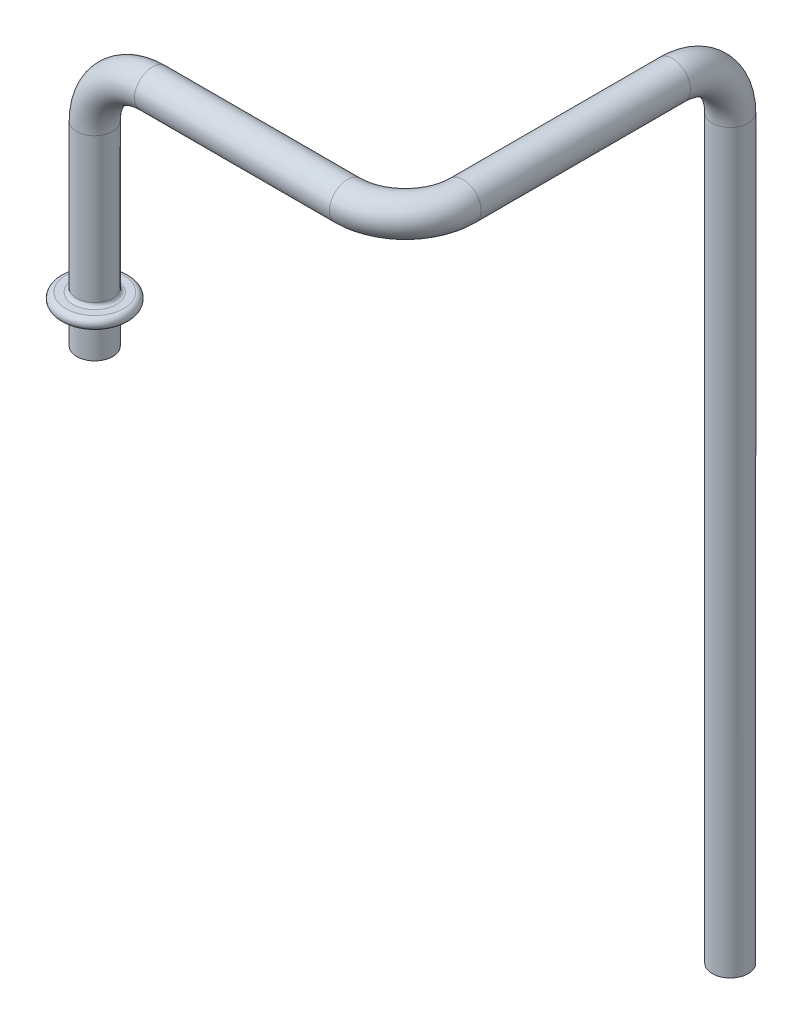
from build123d import *

# Parameters (mm, degrees)
SKETCH2_R   = 2.5
SKETCH2_R_2 = 2
FILLET1_R   = 0.5


with BuildPart() as part:
    # Sweep-Thin1: sweep along a curve in space
    with BuildLine() as sweep_thin1_path:
        Line((0, 0, 0), (0, 27, 0))
        ThreePointArc((0, 27, 0), (2.343145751, 32.656854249, 0), (8, 35, 0))
        Line((8, 35, 0), (35, 35, 0))
        ThreePointArc((35, 35, 0), (40.656854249, 35, -2.343145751), (43, 35, -8))
        Line((43, 35, -8), (43, 35, -37))
        ThreePointArc((43, 35, -37), (43, 32.656854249, -42.656854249), (43, 27, -45))
        Line((43, 27, -45), (43, -75, -45))
    # Sketch2 → Sweep-Thin1 (sweep)
    with BuildSketch(Plane(origin=(0, 0, 0), x_dir=(1, 0, 0), z_dir=(0, 1, 0))):
        Circle(SKETCH2_R)
        Circle(SKETCH2_R_2, mode=Mode.SUBTRACT)
    sweep(path=sweep_thin1_path.line)

    # Sketch3 → Revolve1 (revolve)
    with BuildSketch(Plane(origin=(0, 0, 0), x_dir=(0, 0, -1), z_dir=(1, 0, 0)), mode=Mode.PRIVATE) as revolve1_sk:
        with BuildLine():
            Line((-2.5, 5), (-4, 5))
            ThreePointArc((-4, 5), (-4.75, 5.75), (-4, 6.5))
            Line((-4, 6.5), (-2.5, 6.5))
            Line((-2.5, 6.5), (-2.5, 5))
        make_face()
    revolve(revolve1_sk.sketch.rotate(Axis((0, 0, 0), (0, 1, 0)), 180), axis=Axis((0, 0, 0), (0, 1, 0)))

    # Fillet1
    fillet1_edges = [part.edges().sort_by_distance(p)[0] for p in [
        (-2.5, 6.5, 0),
        (-2.5, 5, 0),
    ]]
    fillet(fillet1_edges, radius=FILLET1_R)


solid = part.part
